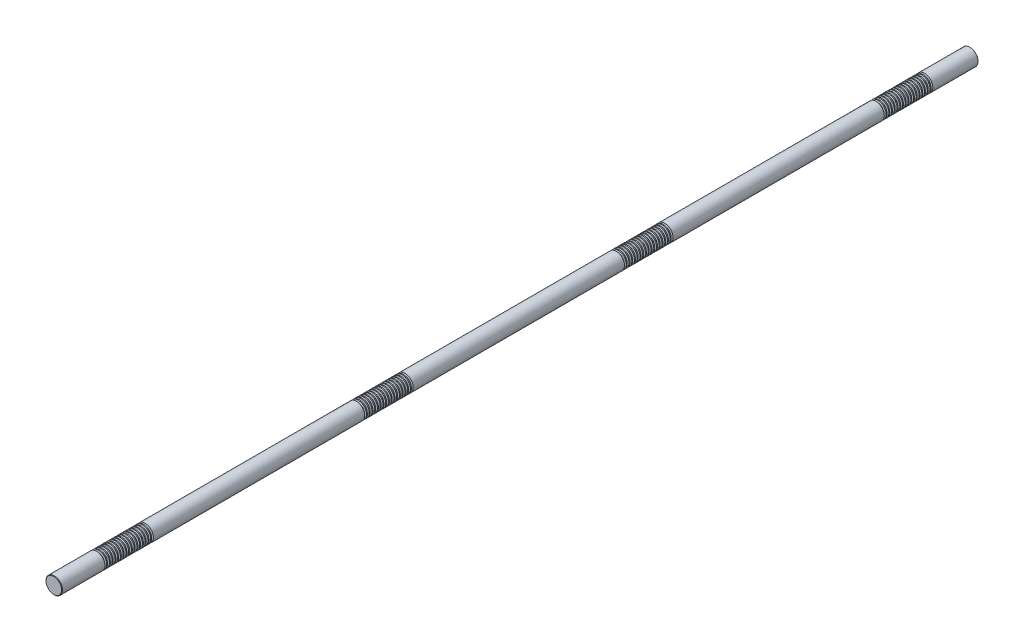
from build123d import *

# Parameters (mm, degrees)
SKETCH1_R           = 18
BOSS_EXTRUDE1_DEPTH = 1000
CHAMFER1_SIZE       = 0.9
LPATTERN1_COUNT     = 18
LPATTERN1_PITCH     = 6
LPATTERN2_COUNT     = 4
LPATTERN2_PITCH     = 567


with BuildPart() as part:
    # Sketch1 → Boss-Extrude1 (new, symmetric)
    with BuildSketch(Plane.XY):
        Circle(SKETCH1_R)
    extrude(amount=BOSS_EXTRUDE1_DEPTH, both=True)

    # Chamfer1
    chamfer1_edges = [part.edges().sort_by_distance(p)[0] for p in [
        (-18, 0, -1000),
        (-18, 0, 1000),
    ]]
    chamfer(chamfer1_edges, length=CHAMFER1_SIZE)

    # Sketch2 → Cut-Revolve1 (revolve, cut)
    with BuildSketch(Plane(origin=(0, 0, 0), x_dir=(0, 0, -1), z_dir=(1, 0, 0)), mode=Mode.PRIVATE) as cut_revolve1_sk:
        Polygon((900.468911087, 18), (896.531088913, 18), (897.468911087, 14.5), (899.531088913, 14.5), align=None)
    cut_revolve1 = revolve(cut_revolve1_sk.sketch.rotate(Axis((0, 0, 1000), (0, 0, -1)), 90), axis=Axis((0, 0, 1000), (0, 0, -1)), mode=Mode.SUBTRACT)

    # LPattern1: Cut-Revolve1 ×18
    with Locations(*[(0, 0, i * LPATTERN1_PITCH) for i in range(1, LPATTERN1_COUNT)]):
        add(cut_revolve1, mode=Mode.SUBTRACT)

    # LPattern2: Cut-Revolve1 ×4
    with Locations(*[(0, 0, i * LPATTERN2_PITCH) for i in range(1, LPATTERN2_COUNT)]):
        add(cut_revolve1, mode=Mode.SUBTRACT)

    # LPattern2 copy 1 sketch → LPattern2 copy 1 (revolve, cut)
    with BuildSketch(Plane(origin=(0, 0, 573), x_dir=(0, 0, -1), z_dir=(1, 0, 0))):
        Polygon((900.468911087, 18), (896.531088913, 18), (897.468911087, 14.5), (899.531088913, 14.5), align=None)
    revolve(axis=Axis((0, 0, 1573), (0, 0, -1)), mode=Mode.SUBTRACT)

    # LPattern2 copy 2 sketch → LPattern2 copy 2 (revolve, cut)
    with BuildSketch(Plane(origin=(0, 0, 1140), x_dir=(0, 0, -1), z_dir=(1, 0, 0))):
        Polygon((900.468911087, 18), (896.531088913, 18), (897.468911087, 14.5), (899.531088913, 14.5), align=None)
    revolve(axis=Axis((0, 0, 2140), (0, 0, -1)), mode=Mode.SUBTRACT)

    # LPattern2 copy 3 sketch → LPattern2 copy 3 (revolve, cut)
    with BuildSketch(Plane(origin=(0, 0, 1707), x_dir=(0, 0, -1), z_dir=(1, 0, 0))):
        Polygon((900.468911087, 18), (896.531088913, 18), (897.468911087, 14.5), (899.531088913, 14.5), align=None)
    revolve(axis=Axis((0, 0, 2707), (0, 0, -1)), mode=Mode.SUBTRACT)

    # LPattern2 copy 4 sketch → LPattern2 copy 4 (revolve, cut)
    with BuildSketch(Plane(origin=(0, 0, 579), x_dir=(0, 0, -1), z_dir=(1, 0, 0))):
        Polygon((900.468911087, 18), (896.531088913, 18), (897.468911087, 14.5), (899.531088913, 14.5), align=None)
    revolve(axis=Axis((0, 0, 1579), (0, 0, -1)), mode=Mode.SUBTRACT)

    # LPattern2 copy 5 sketch → LPattern2 copy 5 (revolve, cut)
    with BuildSketch(Plane(origin=(0, 0, 1146), x_dir=(0, 0, -1), z_dir=(1, 0, 0))):
        Polygon((900.468911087, 18), (896.531088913, 18), (897.468911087, 14.5), (899.531088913, 14.5), align=None)
    revolve(axis=Axis((0, 0, 2146), (0, 0, -1)), mode=Mode.SUBTRACT)

    # LPattern2 copy 6 sketch → LPattern2 copy 6 (revolve, cut)
    with BuildSketch(Plane(origin=(0, 0, 1713), x_dir=(0, 0, -1), z_dir=(1, 0, 0))):
        Polygon((900.468911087, 18), (896.531088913, 18), (897.468911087, 14.5), (899.531088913, 14.5), align=None)
    revolve(axis=Axis((0, 0, 2713), (0, 0, -1)), mode=Mode.SUBTRACT)

    # LPattern2 copy 7 sketch → LPattern2 copy 7 (revolve, cut)
    with BuildSketch(Plane(origin=(0, 0, 585), x_dir=(0, 0, -1), z_dir=(1, 0, 0))):
        Polygon((900.468911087, 18), (896.531088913, 18), (897.468911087, 14.5), (899.531088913, 14.5), align=None)
    revolve(axis=Axis((0, 0, 1585), (0, 0, -1)), mode=Mode.SUBTRACT)

    # LPattern2 copy 8 sketch → LPattern2 copy 8 (revolve, cut)
    with BuildSketch(Plane(origin=(0, 0, 1152), x_dir=(0, 0, -1), z_dir=(1, 0, 0))):
        Polygon((900.468911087, 18), (896.531088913, 18), (897.468911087, 14.5), (899.531088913, 14.5), align=None)
    revolve(axis=Axis((0, 0, 2152), (0, 0, -1)), mode=Mode.SUBTRACT)

    # LPattern2 copy 9 sketch → LPattern2 copy 9 (revolve, cut)
    with BuildSketch(Plane(origin=(0, 0, 1719), x_dir=(0, 0, -1), z_dir=(1, 0, 0))):
        Polygon((900.468911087, 18), (896.531088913, 18), (897.468911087, 14.5), (899.531088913, 14.5), align=None)
    revolve(axis=Axis((0, 0, 2719), (0, 0, -1)), mode=Mode.SUBTRACT)

    # LPattern2 copy 10 sketch → LPattern2 copy 10 (revolve, cut)
    with BuildSketch(Plane(origin=(0, 0, 591), x_dir=(0, 0, -1), z_dir=(1, 0, 0))):
        Polygon((900.468911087, 18), (896.531088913, 18), (897.468911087, 14.5), (899.531088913, 14.5), align=None)
    revolve(axis=Axis((0, 0, 1591), (0, 0, -1)), mode=Mode.SUBTRACT)

    # LPattern2 copy 11 sketch → LPattern2 copy 11 (revolve, cut)
    with BuildSketch(Plane(origin=(0, 0, 1158), x_dir=(0, 0, -1), z_dir=(1, 0, 0))):
        Polygon((900.468911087, 18), (896.531088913, 18), (897.468911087, 14.5), (899.531088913, 14.5), align=None)
    revolve(axis=Axis((0, 0, 2158), (0, 0, -1)), mode=Mode.SUBTRACT)

    # LPattern2 copy 12 sketch → LPattern2 copy 12 (revolve, cut)
    with BuildSketch(Plane(origin=(0, 0, 1725), x_dir=(0, 0, -1), z_dir=(1, 0, 0))):
        Polygon((900.468911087, 18), (896.531088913, 18), (897.468911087, 14.5), (899.531088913, 14.5), align=None)
    revolve(axis=Axis((0, 0, 2725), (0, 0, -1)), mode=Mode.SUBTRACT)

    # LPattern2 copy 13 sketch → LPattern2 copy 13 (revolve, cut)
    with BuildSketch(Plane(origin=(0, 0, 597), x_dir=(0, 0, -1), z_dir=(1, 0, 0))):
        Polygon((900.468911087, 18), (896.531088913, 18), (897.468911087, 14.5), (899.531088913, 14.5), align=None)
    revolve(axis=Axis((0, 0, 1597), (0, 0, -1)), mode=Mode.SUBTRACT)

    # LPattern2 copy 14 sketch → LPattern2 copy 14 (revolve, cut)
    with BuildSketch(Plane(origin=(0, 0, 1164), x_dir=(0, 0, -1), z_dir=(1, 0, 0))):
        Polygon((900.468911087, 18), (896.531088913, 18), (897.468911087, 14.5), (899.531088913, 14.5), align=None)
    revolve(axis=Axis((0, 0, 2164), (0, 0, -1)), mode=Mode.SUBTRACT)

    # LPattern2 copy 15 sketch → LPattern2 copy 15 (revolve, cut)
    with BuildSketch(Plane(origin=(0, 0, 1731), x_dir=(0, 0, -1), z_dir=(1, 0, 0))):
        Polygon((900.468911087, 18), (896.531088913, 18), (897.468911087, 14.5), (899.531088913, 14.5), align=None)
    revolve(axis=Axis((0, 0, 2731), (0, 0, -1)), mode=Mode.SUBTRACT)

    # LPattern2 copy 16 sketch → LPattern2 copy 16 (revolve, cut)
    with BuildSketch(Plane(origin=(0, 0, 603), x_dir=(0, 0, -1), z_dir=(1, 0, 0))):
        Polygon((900.468911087, 18), (896.531088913, 18), (897.468911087, 14.5), (899.531088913, 14.5), align=None)
    revolve(axis=Axis((0, 0, 1603), (0, 0, -1)), mode=Mode.SUBTRACT)

    # LPattern2 copy 17 sketch → LPattern2 copy 17 (revolve, cut)
    with BuildSketch(Plane(origin=(0, 0, 1170), x_dir=(0, 0, -1), z_dir=(1, 0, 0))):
        Polygon((900.468911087, 18), (896.531088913, 18), (897.468911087, 14.5), (899.531088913, 14.5), align=None)
    revolve(axis=Axis((0, 0, 2170), (0, 0, -1)), mode=Mode.SUBTRACT)

    # LPattern2 copy 18 sketch → LPattern2 copy 18 (revolve, cut)
    with BuildSketch(Plane(origin=(0, 0, 1737), x_dir=(0, 0, -1), z_dir=(1, 0, 0))):
        Polygon((900.468911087, 18), (896.531088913, 18), (897.468911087, 14.5), (899.531088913, 14.5), align=None)
    revolve(axis=Axis((0, 0, 2737), (0, 0, -1)), mode=Mode.SUBTRACT)

    # LPattern2 copy 19 sketch → LPattern2 copy 19 (revolve, cut)
    with BuildSketch(Plane(origin=(0, 0, 609), x_dir=(0, 0, -1), z_dir=(1, 0, 0))):
        Polygon((900.468911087, 18), (896.531088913, 18), (897.468911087, 14.5), (899.531088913, 14.5), align=None)
    revolve(axis=Axis((0, 0, 1609), (0, 0, -1)), mode=Mode.SUBTRACT)

    # LPattern2 copy 20 sketch → LPattern2 copy 20 (revolve, cut)
    with BuildSketch(Plane(origin=(0, 0, 1176), x_dir=(0, 0, -1), z_dir=(1, 0, 0))):
        Polygon((900.468911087, 18), (896.531088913, 18), (897.468911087, 14.5), (899.531088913, 14.5), align=None)
    revolve(axis=Axis((0, 0, 2176), (0, 0, -1)), mode=Mode.SUBTRACT)

    # LPattern2 copy 21 sketch → LPattern2 copy 21 (revolve, cut)
    with BuildSketch(Plane(origin=(0, 0, 1743), x_dir=(0, 0, -1), z_dir=(1, 0, 0))):
        Polygon((900.468911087, 18), (896.531088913, 18), (897.468911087, 14.5), (899.531088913, 14.5), align=None)
    revolve(axis=Axis((0, 0, 2743), (0, 0, -1)), mode=Mode.SUBTRACT)

    # LPattern2 copy 22 sketch → LPattern2 copy 22 (revolve, cut)
    with BuildSketch(Plane(origin=(0, 0, 615), x_dir=(0, 0, -1), z_dir=(1, 0, 0))):
        Polygon((900.468911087, 18), (896.531088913, 18), (897.468911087, 14.5), (899.531088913, 14.5), align=None)
    revolve(axis=Axis((0, 0, 1615), (0, 0, -1)), mode=Mode.SUBTRACT)

    # LPattern2 copy 23 sketch → LPattern2 copy 23 (revolve, cut)
    with BuildSketch(Plane(origin=(0, 0, 1182), x_dir=(0, 0, -1), z_dir=(1, 0, 0))):
        Polygon((900.468911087, 18), (896.531088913, 18), (897.468911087, 14.5), (899.531088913, 14.5), align=None)
    revolve(axis=Axis((0, 0, 2182), (0, 0, -1)), mode=Mode.SUBTRACT)

    # LPattern2 copy 24 sketch → LPattern2 copy 24 (revolve, cut)
    with BuildSketch(Plane(origin=(0, 0, 1749), x_dir=(0, 0, -1), z_dir=(1, 0, 0))):
        Polygon((900.468911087, 18), (896.531088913, 18), (897.468911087, 14.5), (899.531088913, 14.5), align=None)
    revolve(axis=Axis((0, 0, 2749), (0, 0, -1)), mode=Mode.SUBTRACT)

    # LPattern2 copy 25 sketch → LPattern2 copy 25 (revolve, cut)
    with BuildSketch(Plane(origin=(0, 0, 621), x_dir=(0, 0, -1), z_dir=(1, 0, 0))):
        Polygon((900.468911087, 18), (896.531088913, 18), (897.468911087, 14.5), (899.531088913, 14.5), align=None)
    revolve(axis=Axis((0, 0, 1621), (0, 0, -1)), mode=Mode.SUBTRACT)

    # LPattern2 copy 26 sketch → LPattern2 copy 26 (revolve, cut)
    with BuildSketch(Plane(origin=(0, 0, 1188), x_dir=(0, 0, -1), z_dir=(1, 0, 0))):
        Polygon((900.468911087, 18), (896.531088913, 18), (897.468911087, 14.5), (899.531088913, 14.5), align=None)
    revolve(axis=Axis((0, 0, 2188), (0, 0, -1)), mode=Mode.SUBTRACT)

    # LPattern2 copy 27 sketch → LPattern2 copy 27 (revolve, cut)
    with BuildSketch(Plane(origin=(0, 0, 1755), x_dir=(0, 0, -1), z_dir=(1, 0, 0))):
        Polygon((900.468911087, 18), (896.531088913, 18), (897.468911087, 14.5), (899.531088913, 14.5), align=None)
    revolve(axis=Axis((0, 0, 2755), (0, 0, -1)), mode=Mode.SUBTRACT)

    # LPattern2 copy 28 sketch → LPattern2 copy 28 (revolve, cut)
    with BuildSketch(Plane(origin=(0, 0, 627), x_dir=(0, 0, -1), z_dir=(1, 0, 0))):
        Polygon((900.468911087, 18), (896.531088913, 18), (897.468911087, 14.5), (899.531088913, 14.5), align=None)
    revolve(axis=Axis((0, 0, 1627), (0, 0, -1)), mode=Mode.SUBTRACT)

    # LPattern2 copy 29 sketch → LPattern2 copy 29 (revolve, cut)
    with BuildSketch(Plane(origin=(0, 0, 1194), x_dir=(0, 0, -1), z_dir=(1, 0, 0))):
        Polygon((900.468911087, 18), (896.531088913, 18), (897.468911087, 14.5), (899.531088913, 14.5), align=None)
    revolve(axis=Axis((0, 0, 2194), (0, 0, -1)), mode=Mode.SUBTRACT)

    # LPattern2 copy 30 sketch → LPattern2 copy 30 (revolve, cut)
    with BuildSketch(Plane(origin=(0, 0, 1761), x_dir=(0, 0, -1), z_dir=(1, 0, 0))):
        Polygon((900.468911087, 18), (896.531088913, 18), (897.468911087, 14.5), (899.531088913, 14.5), align=None)
    revolve(axis=Axis((0, 0, 2761), (0, 0, -1)), mode=Mode.SUBTRACT)

    # LPattern2 copy 31 sketch → LPattern2 copy 31 (revolve, cut)
    with BuildSketch(Plane(origin=(0, 0, 633), x_dir=(0, 0, -1), z_dir=(1, 0, 0))):
        Polygon((900.468911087, 18), (896.531088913, 18), (897.468911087, 14.5), (899.531088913, 14.5), align=None)
    revolve(axis=Axis((0, 0, 1633), (0, 0, -1)), mode=Mode.SUBTRACT)

    # LPattern2 copy 32 sketch → LPattern2 copy 32 (revolve, cut)
    with BuildSketch(Plane(origin=(0, 0, 1200), x_dir=(0, 0, -1), z_dir=(1, 0, 0))):
        Polygon((900.468911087, 18), (896.531088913, 18), (897.468911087, 14.5), (899.531088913, 14.5), align=None)
    revolve(axis=Axis((0, 0, 2200), (0, 0, -1)), mode=Mode.SUBTRACT)

    # LPattern2 copy 33 sketch → LPattern2 copy 33 (revolve, cut)
    with BuildSketch(Plane(origin=(0, 0, 1767), x_dir=(0, 0, -1), z_dir=(1, 0, 0))):
        Polygon((900.468911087, 18), (896.531088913, 18), (897.468911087, 14.5), (899.531088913, 14.5), align=None)
    revolve(axis=Axis((0, 0, 2767), (0, 0, -1)), mode=Mode.SUBTRACT)

    # LPattern2 copy 34 sketch → LPattern2 copy 34 (revolve, cut)
    with BuildSketch(Plane(origin=(0, 0, 639), x_dir=(0, 0, -1), z_dir=(1, 0, 0))):
        Polygon((900.468911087, 18), (896.531088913, 18), (897.468911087, 14.5), (899.531088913, 14.5), align=None)
    revolve(axis=Axis((0, 0, 1639), (0, 0, -1)), mode=Mode.SUBTRACT)

    # LPattern2 copy 35 sketch → LPattern2 copy 35 (revolve, cut)
    with BuildSketch(Plane(origin=(0, 0, 1206), x_dir=(0, 0, -1), z_dir=(1, 0, 0))):
        Polygon((900.468911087, 18), (896.531088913, 18), (897.468911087, 14.5), (899.531088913, 14.5), align=None)
    revolve(axis=Axis((0, 0, 2206), (0, 0, -1)), mode=Mode.SUBTRACT)

    # LPattern2 copy 36 sketch → LPattern2 copy 36 (revolve, cut)
    with BuildSketch(Plane(origin=(0, 0, 1773), x_dir=(0, 0, -1), z_dir=(1, 0, 0))):
        Polygon((900.468911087, 18), (896.531088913, 18), (897.468911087, 14.5), (899.531088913, 14.5), align=None)
    revolve(axis=Axis((0, 0, 2773), (0, 0, -1)), mode=Mode.SUBTRACT)

    # LPattern2 copy 37 sketch → LPattern2 copy 37 (revolve, cut)
    with BuildSketch(Plane(origin=(0, 0, 645), x_dir=(0, 0, -1), z_dir=(1, 0, 0))):
        Polygon((900.468911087, 18), (896.531088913, 18), (897.468911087, 14.5), (899.531088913, 14.5), align=None)
    revolve(axis=Axis((0, 0, 1645), (0, 0, -1)), mode=Mode.SUBTRACT)

    # LPattern2 copy 38 sketch → LPattern2 copy 38 (revolve, cut)
    with BuildSketch(Plane(origin=(0, 0, 1212), x_dir=(0, 0, -1), z_dir=(1, 0, 0))):
        Polygon((900.468911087, 18), (896.531088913, 18), (897.468911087, 14.5), (899.531088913, 14.5), align=None)
    revolve(axis=Axis((0, 0, 2212), (0, 0, -1)), mode=Mode.SUBTRACT)

    # LPattern2 copy 39 sketch → LPattern2 copy 39 (revolve, cut)
    with BuildSketch(Plane(origin=(0, 0, 1779), x_dir=(0, 0, -1), z_dir=(1, 0, 0))):
        Polygon((900.468911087, 18), (896.531088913, 18), (897.468911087, 14.5), (899.531088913, 14.5), align=None)
    revolve(axis=Axis((0, 0, 2779), (0, 0, -1)), mode=Mode.SUBTRACT)

    # LPattern2 copy 40 sketch → LPattern2 copy 40 (revolve, cut)
    with BuildSketch(Plane(origin=(0, 0, 651), x_dir=(0, 0, -1), z_dir=(1, 0, 0))):
        Polygon((900.468911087, 18), (896.531088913, 18), (897.468911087, 14.5), (899.531088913, 14.5), align=None)
    revolve(axis=Axis((0, 0, 1651), (0, 0, -1)), mode=Mode.SUBTRACT)

    # LPattern2 copy 41 sketch → LPattern2 copy 41 (revolve, cut)
    with BuildSketch(Plane(origin=(0, 0, 1218), x_dir=(0, 0, -1), z_dir=(1, 0, 0))):
        Polygon((900.468911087, 18), (896.531088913, 18), (897.468911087, 14.5), (899.531088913, 14.5), align=None)
    revolve(axis=Axis((0, 0, 2218), (0, 0, -1)), mode=Mode.SUBTRACT)

    # LPattern2 copy 42 sketch → LPattern2 copy 42 (revolve, cut)
    with BuildSketch(Plane(origin=(0, 0, 1785), x_dir=(0, 0, -1), z_dir=(1, 0, 0))):
        Polygon((900.468911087, 18), (896.531088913, 18), (897.468911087, 14.5), (899.531088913, 14.5), align=None)
    revolve(axis=Axis((0, 0, 2785), (0, 0, -1)), mode=Mode.SUBTRACT)

    # LPattern2 copy 43 sketch → LPattern2 copy 43 (revolve, cut)
    with BuildSketch(Plane(origin=(0, 0, 657), x_dir=(0, 0, -1), z_dir=(1, 0, 0))):
        Polygon((900.468911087, 18), (896.531088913, 18), (897.468911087, 14.5), (899.531088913, 14.5), align=None)
    revolve(axis=Axis((0, 0, 1657), (0, 0, -1)), mode=Mode.SUBTRACT)

    # LPattern2 copy 44 sketch → LPattern2 copy 44 (revolve, cut)
    with BuildSketch(Plane(origin=(0, 0, 1224), x_dir=(0, 0, -1), z_dir=(1, 0, 0))):
        Polygon((900.468911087, 18), (896.531088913, 18), (897.468911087, 14.5), (899.531088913, 14.5), align=None)
    revolve(axis=Axis((0, 0, 2224), (0, 0, -1)), mode=Mode.SUBTRACT)

    # LPattern2 copy 45 sketch → LPattern2 copy 45 (revolve, cut)
    with BuildSketch(Plane(origin=(0, 0, 1791), x_dir=(0, 0, -1), z_dir=(1, 0, 0))):
        Polygon((900.468911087, 18), (896.531088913, 18), (897.468911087, 14.5), (899.531088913, 14.5), align=None)
    revolve(axis=Axis((0, 0, 2791), (0, 0, -1)), mode=Mode.SUBTRACT)

    # LPattern2 copy 46 sketch → LPattern2 copy 46 (revolve, cut)
    with BuildSketch(Plane(origin=(0, 0, 663), x_dir=(0, 0, -1), z_dir=(1, 0, 0))):
        Polygon((900.468911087, 18), (896.531088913, 18), (897.468911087, 14.5), (899.531088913, 14.5), align=None)
    revolve(axis=Axis((0, 0, 1663), (0, 0, -1)), mode=Mode.SUBTRACT)

    # LPattern2 copy 47 sketch → LPattern2 copy 47 (revolve, cut)
    with BuildSketch(Plane(origin=(0, 0, 1230), x_dir=(0, 0, -1), z_dir=(1, 0, 0))):
        Polygon((900.468911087, 18), (896.531088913, 18), (897.468911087, 14.5), (899.531088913, 14.5), align=None)
    revolve(axis=Axis((0, 0, 2230), (0, 0, -1)), mode=Mode.SUBTRACT)

    # LPattern2 copy 48 sketch → LPattern2 copy 48 (revolve, cut)
    with BuildSketch(Plane(origin=(0, 0, 1797), x_dir=(0, 0, -1), z_dir=(1, 0, 0))):
        Polygon((900.468911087, 18), (896.531088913, 18), (897.468911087, 14.5), (899.531088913, 14.5), align=None)
    revolve(axis=Axis((0, 0, 2797), (0, 0, -1)), mode=Mode.SUBTRACT)

    # LPattern2 copy 49 sketch → LPattern2 copy 49 (revolve, cut)
    with BuildSketch(Plane(origin=(0, 0, 669), x_dir=(0, 0, -1), z_dir=(1, 0, 0))):
        Polygon((900.468911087, 18), (896.531088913, 18), (897.468911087, 14.5), (899.531088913, 14.5), align=None)
    revolve(axis=Axis((0, 0, 1669), (0, 0, -1)), mode=Mode.SUBTRACT)

    # LPattern2 copy 50 sketch → LPattern2 copy 50 (revolve, cut)
    with BuildSketch(Plane(origin=(0, 0, 1236), x_dir=(0, 0, -1), z_dir=(1, 0, 0))):
        Polygon((900.468911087, 18), (896.531088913, 18), (897.468911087, 14.5), (899.531088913, 14.5), align=None)
    revolve(axis=Axis((0, 0, 2236), (0, 0, -1)), mode=Mode.SUBTRACT)

    # LPattern2 copy 51 sketch → LPattern2 copy 51 (revolve, cut)
    with BuildSketch(Plane(origin=(0, 0, 1803), x_dir=(0, 0, -1), z_dir=(1, 0, 0))):
        Polygon((900.468911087, 18), (896.531088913, 18), (897.468911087, 14.5), (899.531088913, 14.5), align=None)
    revolve(axis=Axis((0, 0, 2803), (0, 0, -1)), mode=Mode.SUBTRACT)


solid = part.part
